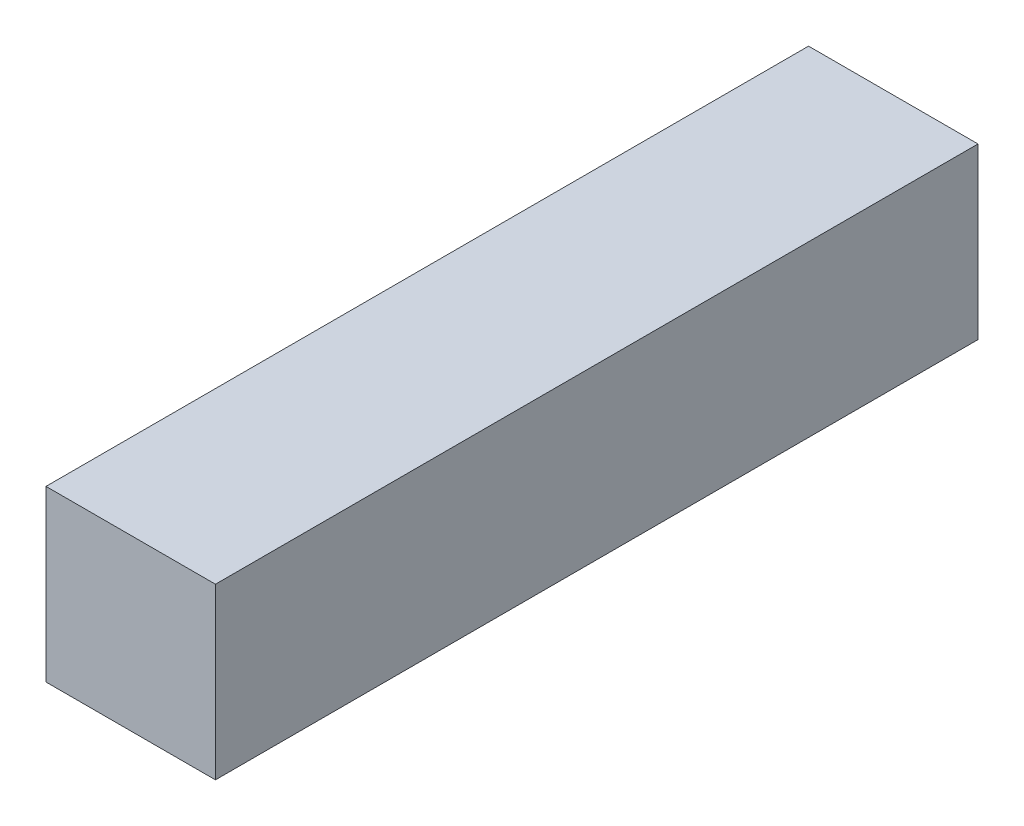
ISO-10303-21;
HEADER;
FILE_DESCRIPTION(('STEP AP214'),'2;1');
FILE_NAME('part.step','',(''),(''),'','','');
FILE_SCHEMA(('AUTOMOTIVE_DESIGN { 1 0 10303 214 1 1 1 1 }'));
ENDSEC;
DATA;
#1=APPLICATION_CONTEXT('core data for automotive mechanical design processes');
#2=APPLICATION_PROTOCOL_DEFINITION('international standard','automotive_design',2000,#1);
#3=PRODUCT_CONTEXT('',#1,'mechanical');
#4=PRODUCT('Part','Part','',(#3));
#5=PRODUCT_RELATED_PRODUCT_CATEGORY('part','',(#4));
#6=PRODUCT_DEFINITION_FORMATION('','',#4);
#7=PRODUCT_DEFINITION_CONTEXT('part definition',#1,'design');
#8=PRODUCT_DEFINITION('design','',#6,#7);
#9=PRODUCT_DEFINITION_SHAPE('','',#8);
#10=(LENGTH_UNIT() NAMED_UNIT(*) SI_UNIT(.MILLI.,.METRE.));
#11=(NAMED_UNIT(*) PLANE_ANGLE_UNIT() SI_UNIT($,.RADIAN.));
#12=(NAMED_UNIT(*) SI_UNIT($,.STERADIAN.) SOLID_ANGLE_UNIT());
#13=UNCERTAINTY_MEASURE_WITH_UNIT(LENGTH_MEASURE(1.E-05),#10,'distance_accuracy_value','');
#14=(GEOMETRIC_REPRESENTATION_CONTEXT(3) GLOBAL_UNCERTAINTY_ASSIGNED_CONTEXT((#13)) GLOBAL_UNIT_ASSIGNED_CONTEXT((#10,
#11,#12)) REPRESENTATION_CONTEXT('',''));
#15=CARTESIAN_POINT('',(0.,0.,0.));
#16=DIRECTION('',(0.,0.,1.));
#17=DIRECTION('',(1.,0.,0.));
#18=AXIS2_PLACEMENT_3D('',#15,#16,#17);
#19=CARTESIAN_POINT('',(0.,0.,90.));
#20=DIRECTION('',(1.,0.,0.));
#21=DIRECTION('',(0.,0.,-1.));
#22=AXIS2_PLACEMENT_3D('',#19,#20,#21);
#23=PLANE('',#22);
#24=DIRECTION('',(0.,-1.,0.));
#25=VECTOR('',#24,1.);
#26=CARTESIAN_POINT('',(0.,0.,0.));
#27=LINE('',#26,#25);
#28=CARTESIAN_POINT('',(0.,20.,-1.52655665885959E-13));
#29=VERTEX_POINT('',#28);
#30=CARTESIAN_POINT('',(0.,0.,0.));
#31=VERTEX_POINT('',#30);
#32=EDGE_CURVE('E73',#29,#31,#27,.T.);
#33=ORIENTED_EDGE('',*,*,#32,.T.);
#34=DIRECTION('',(0.,0.,-1.));
#35=VECTOR('',#34,1.);
#36=CARTESIAN_POINT('',(0.,0.,90.));
#37=LINE('',#36,#35);
#38=CARTESIAN_POINT('',(0.,0.,90.));
#39=VERTEX_POINT('',#38);
#40=EDGE_CURVE('E11',#39,#31,#37,.T.);
#41=ORIENTED_EDGE('',*,*,#40,.F.);
#42=DIRECTION('',(0.,-1.,0.));
#43=VECTOR('',#42,1.);
#44=CARTESIAN_POINT('',(0.,0.,90.));
#45=LINE('',#44,#43);
#46=CARTESIAN_POINT('',(-1.17961196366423E-12,20.,90.));
#47=VERTEX_POINT('',#46);
#48=EDGE_CURVE('E91',#47,#39,#45,.T.);
#49=ORIENTED_EDGE('',*,*,#48,.F.);
#50=DIRECTION('',(0.,0.,-1.));
#51=VECTOR('',#50,1.);
#52=CARTESIAN_POINT('',(-1.17961196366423E-12,20.,90.));
#53=LINE('',#52,#51);
#54=EDGE_CURVE('E85',#47,#29,#53,.T.);
#55=ORIENTED_EDGE('',*,*,#54,.T.);
#56=EDGE_LOOP('',(#33,#41,#49,#55));
#57=FACE_BOUND('',#56,.T.);
#58=ADVANCED_FACE('F29',(#57),#23,.F.);
#59=CARTESIAN_POINT('',(0.,0.,90.));
#60=DIRECTION('',(0.,1.,0.));
#61=DIRECTION('',(0.,0.,1.));
#62=AXIS2_PLACEMENT_3D('',#59,#60,#61);
#63=PLANE('',#62);
#64=DIRECTION('',(1.,0.,0.));
#65=VECTOR('',#64,1.);
#66=CARTESIAN_POINT('',(0.,0.,0.));
#67=LINE('',#66,#65);
#68=CARTESIAN_POINT('',(20.,0.,0.));
#69=VERTEX_POINT('',#68);
#70=EDGE_CURVE('E69',#31,#69,#67,.T.);
#71=ORIENTED_EDGE('',*,*,#70,.T.);
#72=DIRECTION('',(0.,0.,-1.));
#73=VECTOR('',#72,1.);
#74=CARTESIAN_POINT('',(20.,0.,90.));
#75=LINE('',#74,#73);
#76=CARTESIAN_POINT('',(20.,0.,90.));
#77=VERTEX_POINT('',#76);
#78=EDGE_CURVE('E36',#77,#69,#75,.T.);
#79=ORIENTED_EDGE('',*,*,#78,.F.);
#80=DIRECTION('',(1.,0.,0.));
#81=VECTOR('',#80,1.);
#82=CARTESIAN_POINT('',(0.,0.,90.));
#83=LINE('',#82,#81);
#84=EDGE_CURVE('E81',#39,#77,#83,.T.);
#85=ORIENTED_EDGE('',*,*,#84,.F.);
#86=ORIENTED_EDGE('',*,*,#40,.T.);
#87=EDGE_LOOP('',(#71,#79,#85,#86));
#88=FACE_BOUND('',#87,.T.);
#89=ADVANCED_FACE('F80',(#88),#63,.F.);
#90=CARTESIAN_POINT('',(20.,0.,90.));
#91=DIRECTION('',(-1.,0.,0.));
#92=DIRECTION('',(0.,-1.,0.));
#93=AXIS2_PLACEMENT_3D('',#90,#91,#92);
#94=PLANE('',#93);
#95=DIRECTION('',(0.,1.,0.));
#96=VECTOR('',#95,1.);
#97=CARTESIAN_POINT('',(20.,0.,0.));
#98=LINE('',#97,#96);
#99=CARTESIAN_POINT('',(20.,20.,0.));
#100=VERTEX_POINT('',#99);
#101=EDGE_CURVE('E74',#69,#100,#98,.T.);
#102=ORIENTED_EDGE('',*,*,#101,.T.);
#103=DIRECTION('',(0.,0.,-1.));
#104=VECTOR('',#103,1.);
#105=CARTESIAN_POINT('',(19.9999999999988,20.,90.));
#106=LINE('',#105,#104);
#107=CARTESIAN_POINT('',(19.9999999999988,20.,90.));
#108=VERTEX_POINT('',#107);
#109=EDGE_CURVE('E97',#108,#100,#106,.T.);
#110=ORIENTED_EDGE('',*,*,#109,.F.);
#111=DIRECTION('',(0.,1.,0.));
#112=VECTOR('',#111,1.);
#113=CARTESIAN_POINT('',(20.,0.,90.));
#114=LINE('',#113,#112);
#115=EDGE_CURVE('E48',#77,#108,#114,.T.);
#116=ORIENTED_EDGE('',*,*,#115,.F.);
#117=ORIENTED_EDGE('',*,*,#78,.T.);
#118=EDGE_LOOP('',(#102,#110,#116,#117));
#119=FACE_BOUND('',#118,.T.);
#120=ADVANCED_FACE('F100',(#119),#94,.F.);
#121=CARTESIAN_POINT('',(-1.17961196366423E-12,20.,90.));
#122=DIRECTION('',(0.,-1.,0.));
#123=DIRECTION('',(1.,0.,0.));
#124=AXIS2_PLACEMENT_3D('',#121,#122,#123);
#125=PLANE('',#124);
#126=DIRECTION('',(-1.,0.,0.));
#127=VECTOR('',#126,1.);
#128=CARTESIAN_POINT('',(0.,20.,-1.52655665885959E-13));
#129=LINE('',#128,#127);
#130=EDGE_CURVE('E89',#100,#29,#129,.T.);
#131=ORIENTED_EDGE('',*,*,#130,.T.);
#132=ORIENTED_EDGE('',*,*,#54,.F.);
#133=DIRECTION('',(-1.,0.,0.));
#134=VECTOR('',#133,1.);
#135=CARTESIAN_POINT('',(-1.17961196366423E-12,20.,90.));
#136=LINE('',#135,#134);
#137=EDGE_CURVE('E43',#108,#47,#136,.T.);
#138=ORIENTED_EDGE('',*,*,#137,.F.);
#139=ORIENTED_EDGE('',*,*,#109,.T.);
#140=EDGE_LOOP('',(#131,#132,#138,#139));
#141=FACE_BOUND('',#140,.T.);
#142=ADVANCED_FACE('F102',(#141),#125,.F.);
#143=CARTESIAN_POINT('',(0.,0.,90.));
#144=DIRECTION('',(0.,0.,-1.));
#145=DIRECTION('',(-1.,0.,0.));
#146=AXIS2_PLACEMENT_3D('',#143,#144,#145);
#147=PLANE('',#146);
#148=ORIENTED_EDGE('',*,*,#48,.T.);
#149=ORIENTED_EDGE('',*,*,#84,.T.);
#150=ORIENTED_EDGE('',*,*,#115,.T.);
#151=ORIENTED_EDGE('',*,*,#137,.T.);
#152=EDGE_LOOP('',(#148,#149,#150,#151));
#153=FACE_BOUND('',#152,.T.);
#154=ADVANCED_FACE('F103',(#153),#147,.F.);
#155=CARTESIAN_POINT('',(0.,0.,0.));
#156=DIRECTION('',(0.,0.,-1.));
#157=DIRECTION('',(-1.,0.,0.));
#158=AXIS2_PLACEMENT_3D('',#155,#156,#157);
#159=PLANE('',#158);
#160=ORIENTED_EDGE('',*,*,#32,.F.);
#161=ORIENTED_EDGE('',*,*,#130,.F.);
#162=ORIENTED_EDGE('',*,*,#101,.F.);
#163=ORIENTED_EDGE('',*,*,#70,.F.);
#164=EDGE_LOOP('',(#160,#161,#162,#163));
#165=FACE_BOUND('',#164,.T.);
#166=ADVANCED_FACE('F70',(#165),#159,.T.);
#167=CLOSED_SHELL('',(#58,#89,#120,#142,#154,#166));
#168=MANIFOLD_SOLID_BREP('B2',#167);
#169=ADVANCED_BREP_SHAPE_REPRESENTATION('',(#18,#168),#14);
#170=SHAPE_DEFINITION_REPRESENTATION(#9,#169);
ENDSEC;
END-ISO-10303-21;
